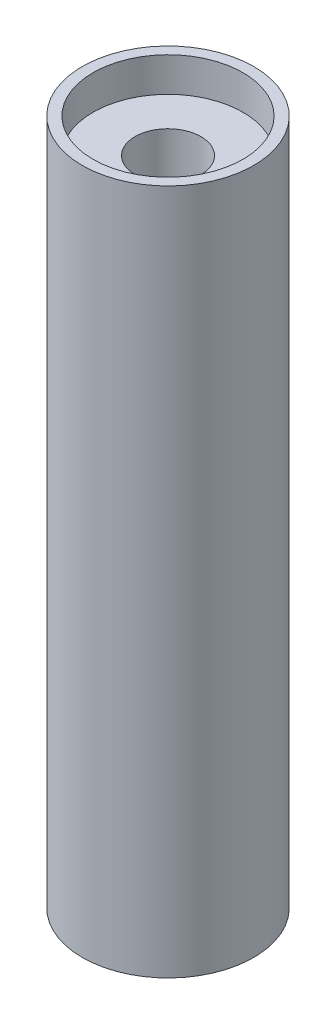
from build123d import *

# Parameters (mm, degrees)
SKETCH1_R                                           = 3.175
BOSS_EXTRUDE1_DEPTH                                 = 25.4
CBORE_FOR_00_BINDING_HEAD_MACHINE_SCREW_D           = 1.397
CBORE_FOR_00_BINDING_HEAD_MACHINE_SCREW_DEPTH       = 6.35
CBORE_FOR_00_BINDING_HEAD_MACHINE_SCREW_CBORE_D     = 3.175
CBORE_FOR_00_BINDING_HEAD_MACHINE_SCREW_CBORE_DEPTH = 0.7112
CBORE_FOR_00_BINDING_HEAD_MACHINE_SCREW_TIP         = 0.419701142
CBORE_FOR_2_BINDING_HEAD_MACHINE_SCREW1_D           = 2.4384
CBORE_FOR_2_BINDING_HEAD_MACHINE_SCREW1_DEPTH       = 6.35
CBORE_FOR_2_BINDING_HEAD_MACHINE_SCREW1_CBORE_D     = 5.55752
CBORE_FOR_2_BINDING_HEAD_MACHINE_SCREW1_CBORE_DEPTH = 1.27
CBORE_FOR_2_BINDING_HEAD_MACHINE_SCREW1_TIP         = 0.732569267


with BuildPart() as part:
    # Sketch1 → Boss-Extrude1 (new body)
    with BuildSketch(Plane(origin=(0, 0, 0), x_dir=(1, 0, 0), z_dir=(0, 1, 0))):
        with Locations(Location((0, 0, 0), (0, 0, 270))):
            Circle(SKETCH1_R)
    extrude(amount=BOSS_EXTRUDE1_DEPTH)

    # CBORE for _00 Binding Head Machine Screw
    with Locations(Plane(origin=(0, 0, 0), x_dir=(-1, 0, 0), z_dir=(0, -1, 0))):
        with Locations((0, 0)):
            CounterBoreHole(CBORE_FOR_00_BINDING_HEAD_MACHINE_SCREW_D / 2, CBORE_FOR_00_BINDING_HEAD_MACHINE_SCREW_CBORE_D / 2, CBORE_FOR_00_BINDING_HEAD_MACHINE_SCREW_CBORE_DEPTH, depth=CBORE_FOR_00_BINDING_HEAD_MACHINE_SCREW_DEPTH)
            with Locations((0, 0, -(CBORE_FOR_00_BINDING_HEAD_MACHINE_SCREW_DEPTH + CBORE_FOR_00_BINDING_HEAD_MACHINE_SCREW_TIP / 2))):  # 118° drill point
                Cone(0, CBORE_FOR_00_BINDING_HEAD_MACHINE_SCREW_D / 2, CBORE_FOR_00_BINDING_HEAD_MACHINE_SCREW_TIP, mode=Mode.SUBTRACT)

    # CBORE for _2 Binding Head Machine Screw1
    with Locations(Plane(origin=(0, 25.4, 0), x_dir=(1, 0, 0), z_dir=(0, 1, 0))):
        with Locations((0, 0)):
            CounterBoreHole(CBORE_FOR_2_BINDING_HEAD_MACHINE_SCREW1_D / 2, CBORE_FOR_2_BINDING_HEAD_MACHINE_SCREW1_CBORE_D / 2, CBORE_FOR_2_BINDING_HEAD_MACHINE_SCREW1_CBORE_DEPTH, depth=CBORE_FOR_2_BINDING_HEAD_MACHINE_SCREW1_DEPTH)
            with Locations((0, 0, -(CBORE_FOR_2_BINDING_HEAD_MACHINE_SCREW1_DEPTH + CBORE_FOR_2_BINDING_HEAD_MACHINE_SCREW1_TIP / 2))):  # 118° drill point
                Cone(0, CBORE_FOR_2_BINDING_HEAD_MACHINE_SCREW1_D / 2, CBORE_FOR_2_BINDING_HEAD_MACHINE_SCREW1_TIP, mode=Mode.SUBTRACT)


solid = part.part
